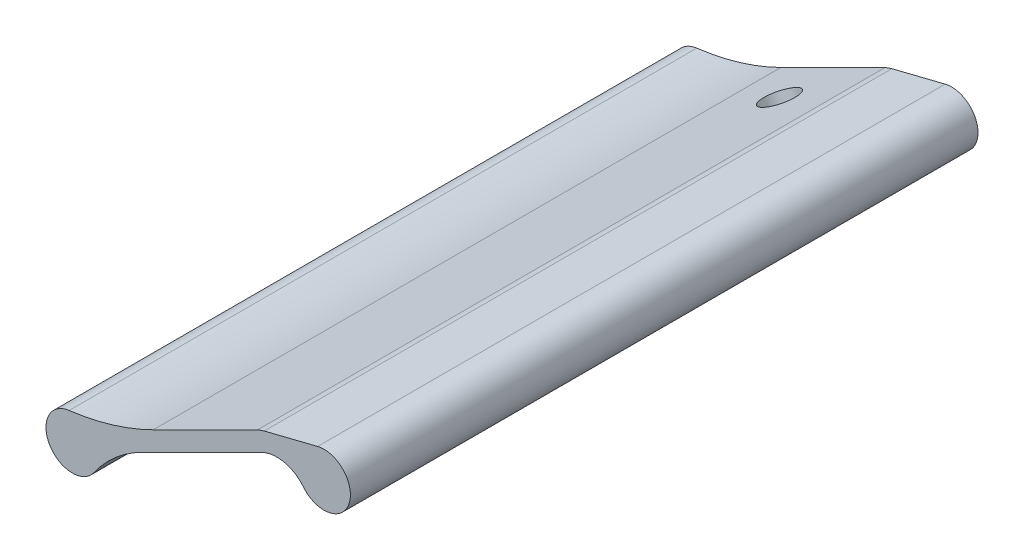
ISO-10303-21;
HEADER;
FILE_DESCRIPTION(('STEP AP214'),'2;1');
FILE_NAME('part.step','',(''),(''),'','','');
FILE_SCHEMA(('AUTOMOTIVE_DESIGN { 1 0 10303 214 1 1 1 1 }'));
ENDSEC;
DATA;
#1=APPLICATION_CONTEXT('core data for automotive mechanical design processes');
#2=APPLICATION_PROTOCOL_DEFINITION('international standard','automotive_design',2000,#1);
#3=PRODUCT_CONTEXT('',#1,'mechanical');
#4=PRODUCT('Part','Part','',(#3));
#5=PRODUCT_RELATED_PRODUCT_CATEGORY('part','',(#4));
#6=PRODUCT_DEFINITION_FORMATION('','',#4);
#7=PRODUCT_DEFINITION_CONTEXT('part definition',#1,'design');
#8=PRODUCT_DEFINITION('design','',#6,#7);
#9=PRODUCT_DEFINITION_SHAPE('','',#8);
#10=(LENGTH_UNIT() NAMED_UNIT(*) SI_UNIT(.MILLI.,.METRE.));
#11=(NAMED_UNIT(*) PLANE_ANGLE_UNIT() SI_UNIT($,.RADIAN.));
#12=(NAMED_UNIT(*) SI_UNIT($,.STERADIAN.) SOLID_ANGLE_UNIT());
#13=UNCERTAINTY_MEASURE_WITH_UNIT(LENGTH_MEASURE(1.E-05),#10,'distance_accuracy_value','');
#14=(GEOMETRIC_REPRESENTATION_CONTEXT(3) GLOBAL_UNCERTAINTY_ASSIGNED_CONTEXT((#13)) GLOBAL_UNIT_ASSIGNED_CONTEXT((#10,
#11,#12)) REPRESENTATION_CONTEXT('',''));
#15=CARTESIAN_POINT('',(0.,0.,0.));
#16=DIRECTION('',(0.,0.,1.));
#17=DIRECTION('',(1.,0.,0.));
#18=AXIS2_PLACEMENT_3D('',#15,#16,#17);
#19=CARTESIAN_POINT('',(23.1849701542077,8.43087862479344,0.));
#20=DIRECTION('',(0.,0.,-1.));
#21=DIRECTION('',(-1.,0.,0.));
#22=AXIS2_PLACEMENT_3D('',#19,#20,#21);
#23=CYLINDRICAL_SURFACE('',#22,3.96);
#24=CARTESIAN_POINT('',(23.1849701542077,8.43087862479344,-72.7));
#25=DIRECTION('',(0.,0.,-1.));
#26=DIRECTION('',(-1.,0.,0.));
#27=AXIS2_PLACEMENT_3D('',#24,#25,#26);
#28=CIRCLE('',#27,3.96);
#29=CARTESIAN_POINT('',(22.226959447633,12.2732497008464,-72.7));
#30=VERTEX_POINT('',#29);
#31=CARTESIAN_POINT('',(21.4180268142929,11.9748186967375,-72.7));
#32=VERTEX_POINT('',#31);
#33=EDGE_CURVE('E95',#30,#32,#28,.F.);
#34=ORIENTED_EDGE('',*,*,#33,.T.);
#35=DIRECTION('',(0.,0.,1.));
#36=VECTOR('',#35,1.);
#37=CARTESIAN_POINT('',(21.4180268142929,11.9748186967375,0.));
#38=LINE('',#37,#36);
#39=CARTESIAN_POINT('',(21.4180268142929,11.9748186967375,0.));
#40=VERTEX_POINT('',#39);
#41=EDGE_CURVE('E93',#40,#32,#38,.F.);
#42=ORIENTED_EDGE('',*,*,#41,.F.);
#43=CARTESIAN_POINT('',(23.1849701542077,8.43087862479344,0.));
#44=DIRECTION('',(0.,0.,-1.));
#45=DIRECTION('',(-1.,0.,0.));
#46=AXIS2_PLACEMENT_3D('',#43,#44,#45);
#47=CIRCLE('',#46,3.96);
#48=CARTESIAN_POINT('',(22.226959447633,12.2732497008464,0.));
#49=VERTEX_POINT('',#48);
#50=EDGE_CURVE('E20',#40,#49,#47,.T.);
#51=ORIENTED_EDGE('',*,*,#50,.T.);
#52=DIRECTION('',(0.,0.,1.));
#53=VECTOR('',#52,1.);
#54=CARTESIAN_POINT('',(22.226959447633,12.2732497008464,0.));
#55=LINE('',#54,#53);
#56=EDGE_CURVE('E90',#30,#49,#55,.T.);
#57=ORIENTED_EDGE('',*,*,#56,.F.);
#58=EDGE_LOOP('',(#34,#42,#51,#57));
#59=FACE_BOUND('',#58,.T.);
#60=ADVANCED_FACE('F17',(#59),#23,.T.);
#61=CARTESIAN_POINT('',(22.226959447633,12.2732497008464,0.));
#62=DIRECTION('',(-0.241921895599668,0.970295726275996,0.));
#63=DIRECTION('',(-0.970295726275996,-0.241921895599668,0.));
#64=AXIS2_PLACEMENT_3D('',#61,#62,#63);
#65=PLANE('',#64);
#66=DIRECTION('',(-0.970295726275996,-0.241921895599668,0.));
#67=VECTOR('',#66,1.);
#68=CARTESIAN_POINT('',(28.4075014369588,13.8142318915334,-72.7));
#69=LINE('',#68,#67);
#70=CARTESIAN_POINT('',(28.4075014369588,13.8142318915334,-72.7));
#71=VERTEX_POINT('',#70);
#72=EDGE_CURVE('E102',#71,#30,#69,.T.);
#73=ORIENTED_EDGE('',*,*,#72,.T.);
#74=ORIENTED_EDGE('',*,*,#56,.T.);
#75=DIRECTION('',(-0.970295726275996,-0.241921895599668,0.));
#76=VECTOR('',#75,1.);
#77=CARTESIAN_POINT('',(28.4075014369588,13.8142318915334,0.));
#78=LINE('',#77,#76);
#79=CARTESIAN_POINT('',(28.4075014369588,13.8142318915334,0.));
#80=VERTEX_POINT('',#79);
#81=EDGE_CURVE('E99',#80,#49,#78,.T.);
#82=ORIENTED_EDGE('',*,*,#81,.F.);
#83=DIRECTION('',(0.,0.,-1.));
#84=VECTOR('',#83,1.);
#85=CARTESIAN_POINT('',(28.4075014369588,13.8142318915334,0.));
#86=LINE('',#85,#84);
#87=EDGE_CURVE('E126',#71,#80,#86,.F.);
#88=ORIENTED_EDGE('',*,*,#87,.F.);
#89=EDGE_LOOP('',(#73,#74,#82,#88));
#90=FACE_BOUND('',#89,.T.);
#91=ADVANCED_FACE('F98',(#90),#65,.T.);
#92=CARTESIAN_POINT('',(-4.02961405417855,32.8538005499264,0.));
#93=DIRECTION('',(0.,0.,-1.));
#94=DIRECTION('',(-1.,0.,0.));
#95=AXIS2_PLACEMENT_3D('',#92,#93,#94);
#96=CYLINDRICAL_SURFACE('',#95,30.04);
#97=DIRECTION('',(0.,0.,1.));
#98=VECTOR('',#97,1.);
#99=CARTESIAN_POINT('',(9.37416825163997,5.96997232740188,0.));
#100=LINE('',#99,#98);
#101=CARTESIAN_POINT('',(9.37416825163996,5.96997232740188,-72.7));
#102=VERTEX_POINT('',#101);
#103=CARTESIAN_POINT('',(9.37416825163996,5.96997232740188,0.));
#104=VERTEX_POINT('',#103);
#105=EDGE_CURVE('E113',#102,#104,#100,.T.);
#106=ORIENTED_EDGE('',*,*,#105,.F.);
#107=CARTESIAN_POINT('',(-4.02961405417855,32.8538005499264,-72.7));
#108=DIRECTION('',(0.,0.,-1.));
#109=DIRECTION('',(-1.,0.,0.));
#110=AXIS2_PLACEMENT_3D('',#107,#108,#109);
#111=CIRCLE('',#110,30.04);
#112=CARTESIAN_POINT('',(-0.372526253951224,3.03723956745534,-72.7));
#113=VERTEX_POINT('',#112);
#114=EDGE_CURVE('E140',#102,#113,#111,.T.);
#115=ORIENTED_EDGE('',*,*,#114,.T.);
#116=DIRECTION('',(0.,0.,-1.));
#117=VECTOR('',#116,1.);
#118=CARTESIAN_POINT('',(-0.37252625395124,3.03723956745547,0.));
#119=LINE('',#118,#117);
#120=CARTESIAN_POINT('',(-0.37252625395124,3.03723956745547,0.));
#121=VERTEX_POINT('',#120);
#122=EDGE_CURVE('E103',#121,#113,#119,.T.);
#123=ORIENTED_EDGE('',*,*,#122,.F.);
#124=CARTESIAN_POINT('',(-4.02961405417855,32.8538005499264,0.));
#125=DIRECTION('',(0.,0.,-1.));
#126=DIRECTION('',(-1.,0.,0.));
#127=AXIS2_PLACEMENT_3D('',#124,#125,#126);
#128=CIRCLE('',#127,30.04);
#129=EDGE_CURVE('E111',#104,#121,#128,.T.);
#130=ORIENTED_EDGE('',*,*,#129,.F.);
#131=EDGE_LOOP('',(#106,#115,#123,#130));
#132=FACE_BOUND('',#131,.T.);
#133=ADVANCED_FACE('F189',(#132),#96,.F.);
#134=CARTESIAN_POINT('',(0.,0.,0.));
#135=DIRECTION('',(0.,0.,-1.));
#136=DIRECTION('',(-1.,0.,0.));
#137=AXIS2_PLACEMENT_3D('',#134,#135,#136);
#138=CYLINDRICAL_SURFACE('',#137,3.06);
#139=CARTESIAN_POINT('',(0.,0.,-72.7));
#140=DIRECTION('',(0.,0.,-1.));
#141=DIRECTION('',(-1.,0.,0.));
#142=AXIS2_PLACEMENT_3D('',#139,#140,#141);
#143=CIRCLE('',#142,3.06);
#144=CARTESIAN_POINT('',(2.50794276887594,-1.7532321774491,-72.7));
#145=VERTEX_POINT('',#144);
#146=EDGE_CURVE('E138',#113,#145,#143,.F.);
#147=ORIENTED_EDGE('',*,*,#146,.T.);
#148=DIRECTION('',(0.,0.,-1.));
#149=VECTOR('',#148,1.);
#150=CARTESIAN_POINT('',(2.50794276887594,-1.75323217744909,0.));
#151=LINE('',#150,#149);
#152=CARTESIAN_POINT('',(2.50794276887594,-1.7532321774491,0.));
#153=VERTEX_POINT('',#152);
#154=EDGE_CURVE('E120',#145,#153,#151,.F.);
#155=ORIENTED_EDGE('',*,*,#154,.T.);
#156=CARTESIAN_POINT('',(0.,0.,0.));
#157=DIRECTION('',(0.,0.,-1.));
#158=DIRECTION('',(-1.,0.,0.));
#159=AXIS2_PLACEMENT_3D('',#156,#157,#158);
#160=CIRCLE('',#159,3.06);
#161=EDGE_CURVE('E123',#121,#153,#160,.F.);
#162=ORIENTED_EDGE('',*,*,#161,.F.);
#163=ORIENTED_EDGE('',*,*,#122,.T.);
#164=EDGE_LOOP('',(#147,#155,#162,#163));
#165=FACE_BOUND('',#164,.T.);
#166=ADVANCED_FACE('F180',(#165),#138,.T.);
#167=CARTESIAN_POINT('',(29.1477824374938,10.8451269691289,0.));
#168=DIRECTION('',(0.,0.,-1.));
#169=DIRECTION('',(-1.,0.,0.));
#170=AXIS2_PLACEMENT_3D('',#167,#168,#169);
#171=CYLINDRICAL_SURFACE('',#170,3.06);
#172=CARTESIAN_POINT('',(29.1477824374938,10.8451269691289,-72.7));
#173=DIRECTION('',(0.,0.,-1.));
#174=DIRECTION('',(-1.,0.,0.));
#175=AXIS2_PLACEMENT_3D('',#172,#173,#174);
#176=CIRCLE('',#175,3.06);
#177=CARTESIAN_POINT('',(26.7654741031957,8.9246564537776,-72.7));
#178=VERTEX_POINT('',#177);
#179=EDGE_CURVE('E143',#178,#71,#176,.F.);
#180=ORIENTED_EDGE('',*,*,#179,.T.);
#181=ORIENTED_EDGE('',*,*,#87,.T.);
#182=CARTESIAN_POINT('',(29.1477824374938,10.8451269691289,0.));
#183=DIRECTION('',(0.,0.,-1.));
#184=DIRECTION('',(-1.,0.,0.));
#185=AXIS2_PLACEMENT_3D('',#182,#183,#184);
#186=CIRCLE('',#185,3.06);
#187=CARTESIAN_POINT('',(26.7654741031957,8.9246564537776,0.));
#188=VERTEX_POINT('',#187);
#189=EDGE_CURVE('E108',#188,#80,#186,.F.);
#190=ORIENTED_EDGE('',*,*,#189,.F.);
#191=DIRECTION('',(0.,0.,-1.));
#192=VECTOR('',#191,1.);
#193=CARTESIAN_POINT('',(26.7654741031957,8.9246564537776,0.));
#194=LINE('',#193,#192);
#195=EDGE_CURVE('E117',#188,#178,#194,.T.);
#196=ORIENTED_EDGE('',*,*,#195,.T.);
#197=EDGE_LOOP('',(#180,#181,#190,#196));
#198=FACE_BOUND('',#197,.T.);
#199=ADVANCED_FACE('F178',(#198),#171,.T.);
#200=CARTESIAN_POINT('',(9.37416825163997,5.96997232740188,0.));
#201=DIRECTION('',(-0.446197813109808,0.894934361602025,0.));
#202=DIRECTION('',(-0.894934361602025,-0.446197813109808,0.));
#203=AXIS2_PLACEMENT_3D('',#200,#201,#202);
#204=PLANE('',#203);
#205=CARTESIAN_POINT('',(15.2064433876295,8.87783744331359,-66.7));
#206=DIRECTION('',(0.446197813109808,-0.894934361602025,0.));
#207=DIRECTION('',(0.894934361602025,0.446197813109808,0.));
#208=AXIS2_PLACEMENT_3D('',#205,#206,#207);
#209=CIRCLE('',#208,2.00000000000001);
#210=CARTESIAN_POINT('',(16.9963121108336,9.77023306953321,-66.7));
#211=VERTEX_POINT('',#210);
#212=EDGE_CURVE('E130',#211,#211,#209,.T.);
#213=ORIENTED_EDGE('',*,*,#212,.T.);
#214=EDGE_LOOP('',(#213));
#215=FACE_BOUND('',#214,.T.);
#216=DIRECTION('',(-0.894934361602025,-0.446197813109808,0.));
#217=VECTOR('',#216,1.);
#218=CARTESIAN_POINT('',(21.4180268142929,11.9748186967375,-72.7));
#219=LINE('',#218,#217);
#220=EDGE_CURVE('E142',#32,#102,#219,.T.);
#221=ORIENTED_EDGE('',*,*,#220,.T.);
#222=ORIENTED_EDGE('',*,*,#105,.T.);
#223=DIRECTION('',(-0.894934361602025,-0.446197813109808,0.));
#224=VECTOR('',#223,1.);
#225=CARTESIAN_POINT('',(21.4180268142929,11.9748186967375,0.));
#226=LINE('',#225,#224);
#227=EDGE_CURVE('E109',#40,#104,#226,.T.);
#228=ORIENTED_EDGE('',*,*,#227,.F.);
#229=ORIENTED_EDGE('',*,*,#41,.T.);
#230=EDGE_LOOP('',(#221,#222,#228,#229));
#231=FACE_BOUND('',#230,.T.);
#232=ADVANCED_FACE('F152',(#215,#231),#204,.T.);
#233=CARTESIAN_POINT('',(14.730620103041,6.73846142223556,0.));
#234=DIRECTION('',(0.,0.,1.));
#235=DIRECTION('',(1.,0.,0.));
#236=AXIS2_PLACEMENT_3D('',#233,#234,#235);
#237=PLANE('',#236);
#238=ORIENTED_EDGE('',*,*,#161,.T.);
#239=CARTESIAN_POINT('',(14.8345634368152,-10.3704256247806,0.));
#240=DIRECTION('',(0.,0.,-1.));
#241=DIRECTION('',(-1.,0.,0.));
#242=AXIS2_PLACEMENT_3D('',#239,#240,#241);
#243=CIRCLE('',#242,15.04);
#244=CARTESIAN_POINT('',(8.12374832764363,3.08938717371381,0.));
#245=VERTEX_POINT('',#244);
#246=EDGE_CURVE('E122',#153,#245,#243,.T.);
#247=ORIENTED_EDGE('',*,*,#246,.T.);
#248=DIRECTION('',(0.894934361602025,0.446197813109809,0.));
#249=VECTOR('',#248,1.);
#250=CARTESIAN_POINT('',(21.9400381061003,9.97793514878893,0.));
#251=LINE('',#250,#249);
#252=CARTESIAN_POINT('',(21.9400381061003,9.97793514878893,0.));
#253=VERTEX_POINT('',#252);
#254=EDGE_CURVE('E133',#253,#245,#251,.F.);
#255=ORIENTED_EDGE('',*,*,#254,.F.);
#256=CARTESIAN_POINT('',(23.698057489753,6.45189376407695,0.));
#257=DIRECTION('',(0.,0.,-1.));
#258=DIRECTION('',(-1.,0.,0.));
#259=AXIS2_PLACEMENT_3D('',#256,#257,#258);
#260=CIRCLE('',#259,3.94);
#261=EDGE_CURVE('E134',#253,#188,#260,.T.);
#262=ORIENTED_EDGE('',*,*,#261,.T.);
#263=ORIENTED_EDGE('',*,*,#189,.T.);
#264=ORIENTED_EDGE('',*,*,#81,.T.);
#265=ORIENTED_EDGE('',*,*,#50,.F.);
#266=ORIENTED_EDGE('',*,*,#227,.T.);
#267=ORIENTED_EDGE('',*,*,#129,.T.);
#268=EDGE_LOOP('',(#238,#247,#255,#262,#263,#264,#265,#266,#267));
#269=FACE_BOUND('',#268,.T.);
#270=ADVANCED_FACE('F106',(#269),#237,.T.);
#271=CARTESIAN_POINT('',(14.8345634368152,-10.3704256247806,0.));
#272=DIRECTION('',(0.,0.,-1.));
#273=DIRECTION('',(-1.,0.,0.));
#274=AXIS2_PLACEMENT_3D('',#271,#272,#273);
#275=CYLINDRICAL_SURFACE('',#274,15.04);
#276=ORIENTED_EDGE('',*,*,#154,.F.);
#277=CARTESIAN_POINT('',(14.8345634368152,-10.3704256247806,-72.7));
#278=DIRECTION('',(0.,0.,-1.));
#279=DIRECTION('',(-1.,0.,0.));
#280=AXIS2_PLACEMENT_3D('',#277,#278,#279);
#281=CIRCLE('',#280,15.04);
#282=CARTESIAN_POINT('',(8.12374832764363,3.08938717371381,-72.7));
#283=VERTEX_POINT('',#282);
#284=EDGE_CURVE('E119',#145,#283,#281,.T.);
#285=ORIENTED_EDGE('',*,*,#284,.T.);
#286=DIRECTION('',(0.,0.,1.));
#287=VECTOR('',#286,1.);
#288=CARTESIAN_POINT('',(8.12374832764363,3.08938717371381,0.));
#289=LINE('',#288,#287);
#290=EDGE_CURVE('E160',#245,#283,#289,.F.);
#291=ORIENTED_EDGE('',*,*,#290,.F.);
#292=ORIENTED_EDGE('',*,*,#246,.F.);
#293=EDGE_LOOP('',(#276,#285,#291,#292));
#294=FACE_BOUND('',#293,.T.);
#295=ADVANCED_FACE('F206',(#294),#275,.F.);
#296=CARTESIAN_POINT('',(14.730620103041,6.73846142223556,-72.7));
#297=DIRECTION('',(0.,0.,1.));
#298=DIRECTION('',(1.,0.,0.));
#299=AXIS2_PLACEMENT_3D('',#296,#297,#298);
#300=PLANE('',#299);
#301=ORIENTED_EDGE('',*,*,#284,.F.);
#302=ORIENTED_EDGE('',*,*,#146,.F.);
#303=ORIENTED_EDGE('',*,*,#114,.F.);
#304=ORIENTED_EDGE('',*,*,#220,.F.);
#305=ORIENTED_EDGE('',*,*,#33,.F.);
#306=ORIENTED_EDGE('',*,*,#72,.F.);
#307=ORIENTED_EDGE('',*,*,#179,.F.);
#308=CARTESIAN_POINT('',(23.698057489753,6.45189376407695,-72.7));
#309=DIRECTION('',(0.,0.,-1.));
#310=DIRECTION('',(-1.,0.,0.));
#311=AXIS2_PLACEMENT_3D('',#308,#309,#310);
#312=CIRCLE('',#311,3.94);
#313=CARTESIAN_POINT('',(21.9400381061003,9.97793514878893,-72.7));
#314=VERTEX_POINT('',#313);
#315=EDGE_CURVE('E35',#178,#314,#312,.F.);
#316=ORIENTED_EDGE('',*,*,#315,.T.);
#317=DIRECTION('',(0.894934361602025,0.446197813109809,0.));
#318=VECTOR('',#317,1.);
#319=CARTESIAN_POINT('',(21.9400381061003,9.97793514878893,-72.7));
#320=LINE('',#319,#318);
#321=EDGE_CURVE('E163',#283,#314,#320,.T.);
#322=ORIENTED_EDGE('',*,*,#321,.F.);
#323=EDGE_LOOP('',(#301,#302,#303,#304,#305,#306,#307,#316,#322));
#324=FACE_BOUND('',#323,.T.);
#325=ADVANCED_FACE('F155',(#324),#300,.F.);
#326=CARTESIAN_POINT('',(23.698057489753,6.45189376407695,0.));
#327=DIRECTION('',(0.,0.,-1.));
#328=DIRECTION('',(-1.,0.,0.));
#329=AXIS2_PLACEMENT_3D('',#326,#327,#328);
#330=CYLINDRICAL_SURFACE('',#329,3.94);
#331=DIRECTION('',(0.,0.,1.));
#332=VECTOR('',#331,1.);
#333=CARTESIAN_POINT('',(21.9400381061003,9.97793514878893,0.));
#334=LINE('',#333,#332);
#335=EDGE_CURVE('E26',#314,#253,#334,.T.);
#336=ORIENTED_EDGE('',*,*,#335,.F.);
#337=ORIENTED_EDGE('',*,*,#315,.F.);
#338=ORIENTED_EDGE('',*,*,#195,.F.);
#339=ORIENTED_EDGE('',*,*,#261,.F.);
#340=EDGE_LOOP('',(#336,#337,#338,#339));
#341=FACE_BOUND('',#340,.T.);
#342=ADVANCED_FACE('F176',(#341),#330,.F.);
#343=CARTESIAN_POINT('',(15.2064433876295,8.87783744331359,-66.7));
#344=DIRECTION('',(0.446197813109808,-0.894934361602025,0.));
#345=DIRECTION('',(0.894934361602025,0.446197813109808,0.));
#346=AXIS2_PLACEMENT_3D('',#343,#344,#345);
#347=CYLINDRICAL_SURFACE('',#346,2.00000000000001);
#348=ORIENTED_EDGE('',*,*,#212,.F.);
#349=EDGE_LOOP('',(#348));
#350=FACE_BOUND('',#349,.T.);
#351=CARTESIAN_POINT('',(16.1077629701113,7.0700700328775,-66.7));
#352=DIRECTION('',(0.446197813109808,-0.894934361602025,0.));
#353=DIRECTION('',(0.894934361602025,0.446197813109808,0.));
#354=AXIS2_PLACEMENT_3D('',#351,#352,#353);
#355=CIRCLE('',#354,2.00000000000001);
#356=CARTESIAN_POINT('',(17.8976316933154,7.96246565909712,-66.7));
#357=VERTEX_POINT('',#356);
#358=EDGE_CURVE('E11',#357,#357,#355,.F.);
#359=ORIENTED_EDGE('',*,*,#358,.F.);
#360=EDGE_LOOP('',(#359));
#361=FACE_BOUND('',#360,.T.);
#362=ADVANCED_FACE('F193',(#350,#361),#347,.F.);
#363=CARTESIAN_POINT('',(21.9400381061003,9.97793514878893,0.));
#364=DIRECTION('',(0.446197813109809,-0.894934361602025,0.));
#365=DIRECTION('',(0.894934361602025,0.446197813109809,0.));
#366=AXIS2_PLACEMENT_3D('',#363,#364,#365);
#367=PLANE('',#366);
#368=ORIENTED_EDGE('',*,*,#358,.T.);
#369=EDGE_LOOP('',(#368));
#370=FACE_BOUND('',#369,.T.);
#371=ORIENTED_EDGE('',*,*,#321,.T.);
#372=ORIENTED_EDGE('',*,*,#335,.T.);
#373=ORIENTED_EDGE('',*,*,#254,.T.);
#374=ORIENTED_EDGE('',*,*,#290,.T.);
#375=EDGE_LOOP('',(#371,#372,#373,#374));
#376=FACE_BOUND('',#375,.T.);
#377=ADVANCED_FACE('F170',(#370,#376),#367,.T.);
#378=CLOSED_SHELL('',(#60,#91,#133,#166,#199,#232,#270,#295,#325,#342,#362,#377));
#379=MANIFOLD_SOLID_BREP('B1',#378);
#380=ADVANCED_BREP_SHAPE_REPRESENTATION('',(#18,#379),#14);
#381=SHAPE_DEFINITION_REPRESENTATION(#9,#380);
ENDSEC;
END-ISO-10303-21;
